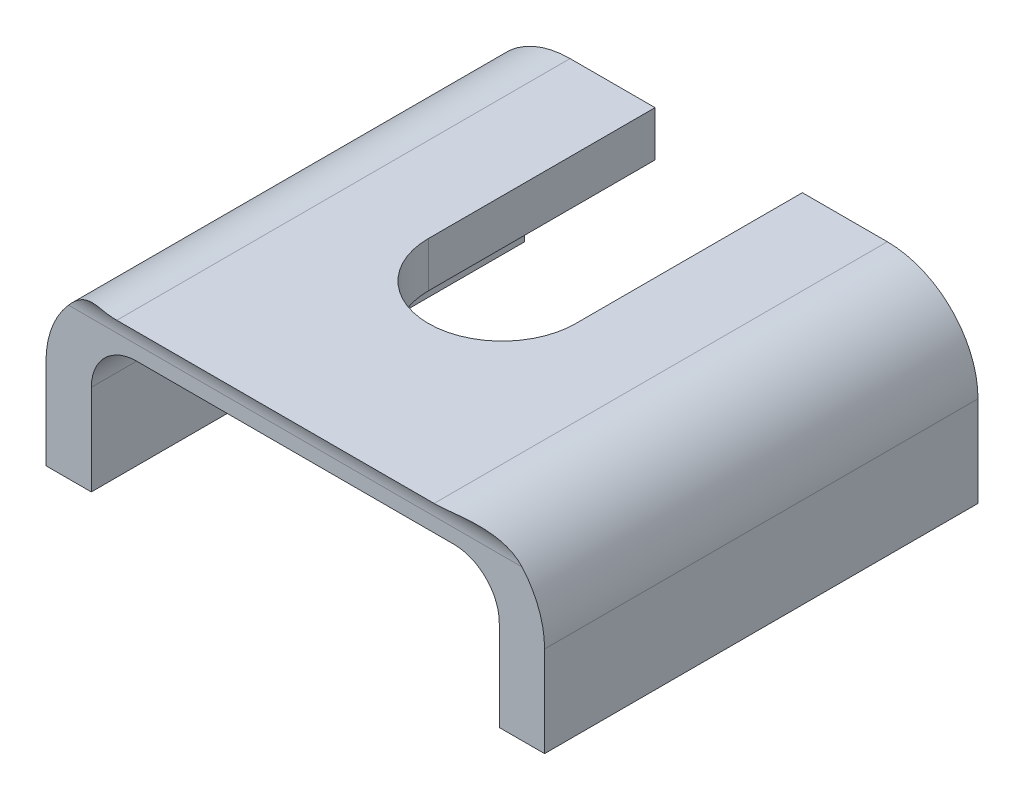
ISO-10303-21;
HEADER;
FILE_DESCRIPTION(('STEP AP214'),'2;1');
FILE_NAME('part.step','',(''),(''),'','','');
FILE_SCHEMA(('AUTOMOTIVE_DESIGN { 1 0 10303 214 1 1 1 1 }'));
ENDSEC;
DATA;
#1=APPLICATION_CONTEXT('core data for automotive mechanical design processes');
#2=APPLICATION_PROTOCOL_DEFINITION('international standard','automotive_design',2000,#1);
#3=PRODUCT_CONTEXT('',#1,'mechanical');
#4=PRODUCT('Part','Part','',(#3));
#5=PRODUCT_RELATED_PRODUCT_CATEGORY('part','',(#4));
#6=PRODUCT_DEFINITION_FORMATION('','',#4);
#7=PRODUCT_DEFINITION_CONTEXT('part definition',#1,'design');
#8=PRODUCT_DEFINITION('design','',#6,#7);
#9=PRODUCT_DEFINITION_SHAPE('','',#8);
#10=(LENGTH_UNIT() NAMED_UNIT(*) SI_UNIT(.MILLI.,.METRE.));
#11=(NAMED_UNIT(*) PLANE_ANGLE_UNIT() SI_UNIT($,.RADIAN.));
#12=(NAMED_UNIT(*) SI_UNIT($,.STERADIAN.) SOLID_ANGLE_UNIT());
#13=UNCERTAINTY_MEASURE_WITH_UNIT(LENGTH_MEASURE(1.E-05),#10,'distance_accuracy_value','');
#14=(GEOMETRIC_REPRESENTATION_CONTEXT(3) GLOBAL_UNCERTAINTY_ASSIGNED_CONTEXT((#13)) GLOBAL_UNIT_ASSIGNED_CONTEXT((#10,
#11,#12)) REPRESENTATION_CONTEXT('',''));
#15=CARTESIAN_POINT('',(0.,0.,0.));
#16=DIRECTION('',(0.,0.,1.));
#17=DIRECTION('',(1.,0.,0.));
#18=AXIS2_PLACEMENT_3D('',#15,#16,#17);
#19=CARTESIAN_POINT('',(187.879071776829,-19.05,60.721875));
#20=DIRECTION('',(0.,0.,1.));
#21=DIRECTION('',(1.,0.,0.));
#22=AXIS2_PLACEMENT_3D('',#19,#20,#21);
#23=PLANE('',#22);
#24=DIRECTION('',(0.,-1.,0.));
#25=VECTOR('',#24,1.);
#26=CARTESIAN_POINT('',(-28.575,0.,60.721875));
#27=LINE('',#26,#25);
#28=CARTESIAN_POINT('',(-28.575,-6.35,60.721875));
#29=VERTEX_POINT('',#28);
#30=CARTESIAN_POINT('',(-28.575,-19.05,60.721875));
#31=VERTEX_POINT('',#30);
#32=EDGE_CURVE('E59',#29,#31,#27,.T.);
#33=ORIENTED_EDGE('',*,*,#32,.F.);
#34=CARTESIAN_POINT('',(-22.225,-6.35,60.721875));
#35=DIRECTION('',(0.,0.,1.));
#36=DIRECTION('',(1.,0.,0.));
#37=AXIS2_PLACEMENT_3D('',#34,#35,#36);
#38=CIRCLE('',#37,6.35);
#39=CARTESIAN_POINT('',(-22.225,0.,60.721875));
#40=VERTEX_POINT('',#39);
#41=EDGE_CURVE('E570',#40,#29,#38,.T.);
#42=ORIENTED_EDGE('',*,*,#41,.F.);
#43=DIRECTION('',(-1.,0.,0.));
#44=VECTOR('',#43,1.);
#45=CARTESIAN_POINT('',(-28.575,0.,60.721875));
#46=LINE('',#45,#44);
#47=CARTESIAN_POINT('',(22.225,0.,60.721875));
#48=VERTEX_POINT('',#47);
#49=EDGE_CURVE('E572',#48,#40,#46,.T.);
#50=ORIENTED_EDGE('',*,*,#49,.F.);
#51=CARTESIAN_POINT('',(22.225,-6.35,60.721875));
#52=DIRECTION('',(0.,0.,1.));
#53=DIRECTION('',(1.,0.,0.));
#54=AXIS2_PLACEMENT_3D('',#51,#52,#53);
#55=CIRCLE('',#54,6.35);
#56=CARTESIAN_POINT('',(28.575,-6.35,60.721875));
#57=VERTEX_POINT('',#56);
#58=EDGE_CURVE('E576',#57,#48,#55,.T.);
#59=ORIENTED_EDGE('',*,*,#58,.F.);
#60=DIRECTION('',(0.,1.,0.));
#61=VECTOR('',#60,1.);
#62=CARTESIAN_POINT('',(28.575,0.,60.721875));
#63=LINE('',#62,#61);
#64=CARTESIAN_POINT('',(28.575,-19.05,60.721875));
#65=VERTEX_POINT('',#64);
#66=EDGE_CURVE('E585',#65,#57,#63,.T.);
#67=ORIENTED_EDGE('',*,*,#66,.F.);
#68=DIRECTION('',(-1.,0.,0.));
#69=VECTOR('',#68,1.);
#70=CARTESIAN_POINT('',(187.879071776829,-19.05,60.721875));
#71=LINE('',#70,#69);
#72=CARTESIAN_POINT('',(34.925,-19.05,60.721875));
#73=VERTEX_POINT('',#72);
#74=EDGE_CURVE('E177',#73,#65,#71,.T.);
#75=ORIENTED_EDGE('',*,*,#74,.F.);
#76=DIRECTION('',(0.,1.,0.));
#77=VECTOR('',#76,1.);
#78=CARTESIAN_POINT('',(34.925,0.,60.721875));
#79=LINE('',#78,#77);
#80=CARTESIAN_POINT('',(34.925,-6.34999999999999,60.721875));
#81=VERTEX_POINT('',#80);
#82=EDGE_CURVE('E584',#73,#81,#79,.T.);
#83=ORIENTED_EDGE('',*,*,#82,.T.);
#84=CARTESIAN_POINT('',(22.225,-6.35,60.721875));
#85=DIRECTION('',(0.,0.,1.));
#86=DIRECTION('',(1.,0.,0.));
#87=AXIS2_PLACEMENT_3D('',#84,#85,#86);
#88=CIRCLE('',#87,12.7);
#89=CARTESIAN_POINT('',(31.7760718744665,2.02060487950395,60.721875));
#90=VERTEX_POINT('',#89);
#91=EDGE_CURVE('E175',#81,#90,#88,.T.);
#92=ORIENTED_EDGE('',*,*,#91,.T.);
#93=DIRECTION('',(-1.,0.,0.));
#94=VECTOR('',#93,1.);
#95=CARTESIAN_POINT('',(187.879071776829,2.02060487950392,60.721875));
#96=LINE('',#95,#94);
#97=CARTESIAN_POINT('',(-31.7760718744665,2.02060487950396,60.721875));
#98=VERTEX_POINT('',#97);
#99=EDGE_CURVE('E169',#90,#98,#96,.T.);
#100=ORIENTED_EDGE('',*,*,#99,.T.);
#101=CARTESIAN_POINT('',(-22.225,-6.35,60.721875));
#102=DIRECTION('',(0.,0.,1.));
#103=DIRECTION('',(1.,0.,0.));
#104=AXIS2_PLACEMENT_3D('',#101,#102,#103);
#105=CIRCLE('',#104,12.7);
#106=CARTESIAN_POINT('',(-34.925,-6.35,60.721875));
#107=VERTEX_POINT('',#106);
#108=EDGE_CURVE('E11',#98,#107,#105,.T.);
#109=ORIENTED_EDGE('',*,*,#108,.T.);
#110=DIRECTION('',(0.,-1.,0.));
#111=VECTOR('',#110,1.);
#112=CARTESIAN_POINT('',(-34.925,0.,60.721875));
#113=LINE('',#112,#111);
#114=CARTESIAN_POINT('',(-34.925,-19.05,60.721875));
#115=VERTEX_POINT('',#114);
#116=EDGE_CURVE('E187',#107,#115,#113,.T.);
#117=ORIENTED_EDGE('',*,*,#116,.T.);
#118=EDGE_CURVE('E51',#31,#115,#71,.T.);
#119=ORIENTED_EDGE('',*,*,#118,.F.);
#120=EDGE_LOOP('',(#33,#42,#50,#59,#67,#75,#83,#92,#100,#109,#117,#119));
#121=FACE_BOUND('',#120,.T.);
#122=ADVANCED_FACE('F36',(#121),#23,.T.);
#123=CARTESIAN_POINT('',(187.879071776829,2.02060487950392,65.484375));
#124=DIRECTION('',(-1.,0.,0.));
#125=DIRECTION('',(0.,-1.,0.));
#126=AXIS2_PLACEMENT_3D('',#123,#124,#125);
#127=CYLINDRICAL_SURFACE('',#126,4.76250000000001);
#128=ORIENTED_EDGE('',*,*,#99,.F.);
#129=CARTESIAN_POINT('',(31.7760718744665,2.02060487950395,60.721875));
#130=CARTESIAN_POINT('',(31.6424498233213,2.17310917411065,60.7218945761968));
#131=CARTESIAN_POINT('',(31.5052236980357,2.32228408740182,60.7291966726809));
#132=CARTESIAN_POINT('',(31.2246195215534,2.61311589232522,60.7566187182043));
#133=CARTESIAN_POINT('',(31.0812504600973,2.75478313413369,60.7767204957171));
#134=CARTESIAN_POINT('',(30.7904475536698,3.0288431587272,60.8277563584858));
#135=CARTESIAN_POINT('',(30.6430664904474,3.16131244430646,60.8585837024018));
#136=CARTESIAN_POINT('',(30.3435491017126,3.418219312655,60.9296136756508));
#137=CARTESIAN_POINT('',(30.1914104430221,3.54265285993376,60.9698209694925));
#138=CARTESIAN_POINT('',(29.786003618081,3.85895205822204,61.0860239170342));
#139=CARTESIAN_POINT('',(29.5292967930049,4.04402171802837,61.1686261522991));
#140=CARTESIAN_POINT('',(29.0067926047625,4.39225244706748,61.3497372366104));
#141=CARTESIAN_POINT('',(28.7409909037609,4.55540287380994,61.4482537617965));
#142=CARTESIAN_POINT('',(28.1992597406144,4.86141529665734,61.6573886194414));
#143=CARTESIAN_POINT('',(27.9232628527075,5.00409080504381,61.7681037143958));
#144=CARTESIAN_POINT('',(27.3640368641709,5.26791247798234,61.996283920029));
#145=CARTESIAN_POINT('',(27.0808100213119,5.38906527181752,62.113746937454));
#146=CARTESIAN_POINT('',(26.5381766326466,5.59828997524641,62.3375649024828));
#147=CARTESIAN_POINT('',(26.279525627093,5.68852596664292,62.4437400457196));
#148=CARTESIAN_POINT('',(25.7556248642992,5.85246188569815,62.6531317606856));
#149=CARTESIAN_POINT('',(25.4903712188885,5.92615180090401,62.756346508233));
#150=CARTESIAN_POINT('',(24.9552794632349,6.05607217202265,62.9525631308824));
#151=CARTESIAN_POINT('',(24.6855213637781,6.11248191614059,63.045662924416));
#152=CARTESIAN_POINT('',(24.1376083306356,6.20822425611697,63.2139933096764));
#153=CARTESIAN_POINT('',(23.859467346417,6.24758370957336,63.2892519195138));
#154=CARTESIAN_POINT('',(23.4670358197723,6.28960514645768,63.3730366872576));
#155=CARTESIAN_POINT('',(23.3562601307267,6.3000090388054,63.3942705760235));
#156=CARTESIAN_POINT('',(23.1335969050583,6.31794868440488,63.431410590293));
#157=CARTESIAN_POINT('',(23.0217096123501,6.32548505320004,63.4473178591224));
#158=CARTESIAN_POINT('',(22.7959791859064,6.33766593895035,63.4732529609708));
#159=CARTESIAN_POINT('',(22.6821276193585,6.34228153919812,63.4832219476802));
#160=CARTESIAN_POINT('',(22.4538589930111,6.34845343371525,63.4966261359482));
#161=CARTESIAN_POINT('',(22.3394415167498,6.35000697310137,63.5000554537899));
#162=CARTESIAN_POINT('',(22.225,6.35,63.5));
#163=B_SPLINE_CURVE_WITH_KNOTS('',3,(#129,#130,#131,#132,#133,#134,#135,#136,#137,#138,#139,
#140,#141,#142,#143,#144,#145,#146,#147,#148,#149,#150,#151,#152,#153,#154,#155,#156,#157,#158,
#159,#160,#161,#162),.UNSPECIFIED.,.F.,.F.,(4,2,2,2,2,2,2,2,2,2,2,2,2,2,2,2,4),(0.,
0.607910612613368,1.21496010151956,1.81613329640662,2.41760608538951,3.39726866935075,
4.37740520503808,5.36596839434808,6.35422656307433,7.23510595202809,8.11651695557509,
8.98844641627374,9.85899737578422,10.1986742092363,10.5382780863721,10.8811936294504,
11.2244175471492),.UNSPECIFIED.);
#164=CARTESIAN_POINT('',(22.225,6.35,63.5));
#165=VERTEX_POINT('',#164);
#166=EDGE_CURVE('E180',#90,#165,#163,.T.);
#167=ORIENTED_EDGE('',*,*,#166,.T.);
#168=DIRECTION('',(1.,0.,0.));
#169=VECTOR('',#168,1.);
#170=CARTESIAN_POINT('',(-28.575,6.35,63.5));
#171=LINE('',#170,#169);
#172=CARTESIAN_POINT('',(-22.225,6.35,63.5));
#173=VERTEX_POINT('',#172);
#174=EDGE_CURVE('E171',#165,#173,#171,.F.);
#175=ORIENTED_EDGE('',*,*,#174,.T.);
#176=CARTESIAN_POINT('',(-22.225,6.35,63.5));
#177=CARTESIAN_POINT('',(-22.3277513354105,6.35000465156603,63.5000367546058));
#178=CARTESIAN_POINT('',(-22.430488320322,6.34875320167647,63.4972801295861));
#179=CARTESIAN_POINT('',(-22.6355649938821,6.3437748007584,63.4864582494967));
#180=CARTESIAN_POINT('',(-22.7379048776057,6.34004927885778,63.4783960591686));
#181=CARTESIAN_POINT('',(-22.941451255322,6.33018295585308,63.4572910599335));
#182=CARTESIAN_POINT('',(-23.0426608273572,6.32405376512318,63.4442722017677));
#183=CARTESIAN_POINT('',(-23.2442278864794,6.3094386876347,63.4137232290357));
#184=CARTESIAN_POINT('',(-23.3445852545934,6.30095247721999,63.3961924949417));
#185=CARTESIAN_POINT('',(-23.6420703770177,6.27225498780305,63.3380456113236));
#186=CARTESIAN_POINT('',(-23.8377548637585,6.24869814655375,63.2916304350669));
#187=CARTESIAN_POINT('',(-24.2250545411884,6.19305215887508,63.1875156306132));
#188=CARTESIAN_POINT('',(-24.4166632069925,6.16095030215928,63.1297992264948));
#189=CARTESIAN_POINT('',(-24.780178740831,6.0915595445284,63.0119217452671));
#190=CARTESIAN_POINT('',(-24.9524057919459,6.05491801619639,62.9523562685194));
#191=CARTESIAN_POINT('',(-25.2938202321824,5.9748972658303,62.8291201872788));
#192=CARTESIAN_POINT('',(-25.4630070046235,5.93151669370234,62.765448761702));
#193=CARTESIAN_POINT('',(-25.7986544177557,5.83808217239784,62.6357499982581));
#194=CARTESIAN_POINT('',(-25.9651144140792,5.78802667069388,62.569722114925));
#195=CARTESIAN_POINT('',(-26.2955001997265,5.68125754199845,62.4367015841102));
#196=CARTESIAN_POINT('',(-26.4594257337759,5.62454324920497,62.3697088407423));
#197=CARTESIAN_POINT('',(-26.9498896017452,5.44353797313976,62.1681041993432));
#198=CARTESIAN_POINT('',(-27.2728406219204,5.30901783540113,62.0337796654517));
#199=CARTESIAN_POINT('',(-27.909154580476,5.01236959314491,61.7736161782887));
#200=CARTESIAN_POINT('',(-28.2225232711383,4.85025845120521,61.6477720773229));
#201=CARTESIAN_POINT('',(-28.7486783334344,4.5492963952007,61.4458512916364));
#202=CARTESIAN_POINT('',(-28.9640648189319,4.41751975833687,61.36598714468));
#203=CARTESIAN_POINT('',(-29.389062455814,4.13955087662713,61.2163079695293));
#204=CARTESIAN_POINT('',(-29.5986727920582,3.99335661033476,61.1464943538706));
#205=CARTESIAN_POINT('',(-30.0100249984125,3.6873667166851,61.0200078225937));
#206=CARTESIAN_POINT('',(-30.2118034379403,3.52764932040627,60.9632655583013));
#207=CARTESIAN_POINT('',(-30.6073605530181,3.19425764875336,60.8654905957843));
#208=CARTESIAN_POINT('',(-30.8011447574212,3.02059327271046,60.8244468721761));
#209=CARTESIAN_POINT('',(-31.1264020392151,2.71037808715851,60.7702460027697));
#210=CARTESIAN_POINT('',(-31.2601547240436,2.57701798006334,60.7525011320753));
#211=CARTESIAN_POINT('',(-31.5223571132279,2.30362508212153,60.7283103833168));
#212=CARTESIAN_POINT('',(-31.6507938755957,2.16357761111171,60.721890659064));
#213=CARTESIAN_POINT('',(-31.7760718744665,2.02060487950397,60.721875));
#214=B_SPLINE_CURVE_WITH_KNOTS('',3,(#176,#177,#178,#179,#180,#181,#182,#183,#184,#185,#186,
#187,#188,#189,#190,#191,#192,#193,#194,#195,#196,#197,#198,#199,#200,#201,#202,#203,#204,#205,
#206,#207,#208,#209,#210,#211,#212,#213),.UNSPECIFIED.,.F.,.F.,(4,2,2,2,2,2,2,2,2,2,2,2,2,2,2,2,
2,2,4),(0.,0.308186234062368,0.616194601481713,0.922733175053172,1.22931386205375,
1.83602123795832,2.44363615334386,3.0010678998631,3.55861146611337,4.116284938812,
4.67401421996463,5.79704810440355,6.91939404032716,7.71332410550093,8.50736564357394,
9.2970921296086,10.0862629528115,10.6548968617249,11.2248422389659),.UNSPECIFIED.);
#215=EDGE_CURVE('E44',#173,#98,#214,.T.);
#216=ORIENTED_EDGE('',*,*,#215,.T.);
#217=EDGE_LOOP('',(#128,#167,#175,#216));
#218=FACE_BOUND('',#217,.T.);
#219=ADVANCED_FACE('F167',(#218),#127,.F.);
#220=CARTESIAN_POINT('',(-34.925,0.,63.5));
#221=DIRECTION('',(1.,0.,0.));
#222=DIRECTION('',(0.,1.,0.));
#223=AXIS2_PLACEMENT_3D('',#220,#221,#222);
#224=PLANE('',#223);
#225=ORIENTED_EDGE('',*,*,#116,.F.);
#226=DIRECTION('',(0.,0.,-1.));
#227=VECTOR('',#226,1.);
#228=CARTESIAN_POINT('',(-34.925,-6.35,63.5));
#229=LINE('',#228,#227);
#230=CARTESIAN_POINT('',(-34.925,-6.35,0.));
#231=VERTEX_POINT('',#230);
#232=EDGE_CURVE('E160',#107,#231,#229,.T.);
#233=ORIENTED_EDGE('',*,*,#232,.T.);
#234=DIRECTION('',(0.,-1.,0.));
#235=VECTOR('',#234,1.);
#236=CARTESIAN_POINT('',(-34.925,0.,0.));
#237=LINE('',#236,#235);
#238=CARTESIAN_POINT('',(-34.925,-19.05,0.));
#239=VERTEX_POINT('',#238);
#240=EDGE_CURVE('E556',#231,#239,#237,.T.);
#241=ORIENTED_EDGE('',*,*,#240,.T.);
#242=DIRECTION('',(0.,0.,-1.));
#243=VECTOR('',#242,1.);
#244=CARTESIAN_POINT('',(-34.925,-19.05,63.5));
#245=LINE('',#244,#243);
#246=EDGE_CURVE('E524',#115,#239,#245,.T.);
#247=ORIENTED_EDGE('',*,*,#246,.F.);
#248=EDGE_LOOP('',(#225,#233,#241,#247));
#249=FACE_BOUND('',#248,.T.);
#250=ADVANCED_FACE('F196',(#249),#224,.F.);
#251=CARTESIAN_POINT('',(-28.575,-19.05,63.5));
#252=DIRECTION('',(0.,-1.,0.));
#253=DIRECTION('',(0.,0.,-1.));
#254=AXIS2_PLACEMENT_3D('',#251,#252,#253);
#255=PLANE('',#254);
#256=DIRECTION('',(0.,0.,-1.));
#257=VECTOR('',#256,1.);
#258=CARTESIAN_POINT('',(-28.575,-19.05,63.5));
#259=LINE('',#258,#257);
#260=CARTESIAN_POINT('',(-28.575,-19.05,0.));
#261=VERTEX_POINT('',#260);
#262=EDGE_CURVE('E522',#31,#261,#259,.T.);
#263=ORIENTED_EDGE('',*,*,#262,.F.);
#264=ORIENTED_EDGE('',*,*,#118,.T.);
#265=ORIENTED_EDGE('',*,*,#246,.T.);
#266=DIRECTION('',(-1.,0.,0.));
#267=VECTOR('',#266,1.);
#268=CARTESIAN_POINT('',(-28.575,-19.05,0.));
#269=LINE('',#268,#267);
#270=EDGE_CURVE('E560',#261,#239,#269,.T.);
#271=ORIENTED_EDGE('',*,*,#270,.F.);
#272=EDGE_LOOP('',(#263,#264,#265,#271));
#273=FACE_BOUND('',#272,.T.);
#274=ADVANCED_FACE('F239',(#273),#255,.T.);
#275=CARTESIAN_POINT('',(-28.575,0.,63.5));
#276=DIRECTION('',(1.,0.,0.));
#277=DIRECTION('',(0.,1.,0.));
#278=AXIS2_PLACEMENT_3D('',#275,#276,#277);
#279=PLANE('',#278);
#280=DIRECTION('',(0.,0.,-1.));
#281=VECTOR('',#280,1.);
#282=CARTESIAN_POINT('',(-28.575,-6.35,63.5));
#283=LINE('',#282,#281);
#284=CARTESIAN_POINT('',(-28.575,-6.35,0.));
#285=VERTEX_POINT('',#284);
#286=EDGE_CURVE('E520',#29,#285,#283,.T.);
#287=ORIENTED_EDGE('',*,*,#286,.F.);
#288=ORIENTED_EDGE('',*,*,#32,.T.);
#289=ORIENTED_EDGE('',*,*,#262,.T.);
#290=DIRECTION('',(0.,-1.,0.));
#291=VECTOR('',#290,1.);
#292=CARTESIAN_POINT('',(-28.575,0.,0.));
#293=LINE('',#292,#291);
#294=EDGE_CURVE('E481',#285,#261,#293,.T.);
#295=ORIENTED_EDGE('',*,*,#294,.F.);
#296=EDGE_LOOP('',(#287,#288,#289,#295));
#297=FACE_BOUND('',#296,.T.);
#298=ADVANCED_FACE('F247',(#297),#279,.T.);
#299=CARTESIAN_POINT('',(-22.225,-6.35,63.5));
#300=DIRECTION('',(0.,0.,-1.));
#301=DIRECTION('',(-1.,0.,0.));
#302=AXIS2_PLACEMENT_3D('',#299,#300,#301);
#303=CYLINDRICAL_SURFACE('',#302,6.35);
#304=DIRECTION('',(0.,0.,-1.));
#305=VECTOR('',#304,1.);
#306=CARTESIAN_POINT('',(-22.225,0.,63.5));
#307=LINE('',#306,#305);
#308=CARTESIAN_POINT('',(-22.225,0.,0.));
#309=VERTEX_POINT('',#308);
#310=EDGE_CURVE('E474',#40,#309,#307,.T.);
#311=ORIENTED_EDGE('',*,*,#310,.F.);
#312=ORIENTED_EDGE('',*,*,#41,.T.);
#313=ORIENTED_EDGE('',*,*,#286,.T.);
#314=CARTESIAN_POINT('',(-22.225,-6.35,0.));
#315=DIRECTION('',(0.,0.,-1.));
#316=DIRECTION('',(-1.,0.,0.));
#317=AXIS2_PLACEMENT_3D('',#314,#315,#316);
#318=CIRCLE('',#317,6.35);
#319=EDGE_CURVE('E476',#309,#285,#318,.F.);
#320=ORIENTED_EDGE('',*,*,#319,.F.);
#321=EDGE_LOOP('',(#311,#312,#313,#320));
#322=FACE_BOUND('',#321,.T.);
#323=ADVANCED_FACE('F254',(#322),#303,.F.);
#324=CARTESIAN_POINT('',(-28.575,0.,63.5));
#325=DIRECTION('',(0.,-1.,0.));
#326=DIRECTION('',(0.,0.,-1.));
#327=AXIS2_PLACEMENT_3D('',#324,#325,#326);
#328=PLANE('',#327);
#329=DIRECTION('',(0.,0.,-1.));
#330=VECTOR('',#329,1.);
#331=CARTESIAN_POINT('',(22.225,0.,63.5));
#332=LINE('',#331,#330);
#333=CARTESIAN_POINT('',(22.225,0.,0.));
#334=VERTEX_POINT('',#333);
#335=EDGE_CURVE('E517',#48,#334,#332,.T.);
#336=ORIENTED_EDGE('',*,*,#335,.F.);
#337=ORIENTED_EDGE('',*,*,#49,.T.);
#338=ORIENTED_EDGE('',*,*,#310,.T.);
#339=DIRECTION('',(-1.,0.,0.));
#340=VECTOR('',#339,1.);
#341=CARTESIAN_POINT('',(-28.575,0.,0.));
#342=LINE('',#341,#340);
#343=CARTESIAN_POINT('',(-10.31875,0.,0.));
#344=VERTEX_POINT('',#343);
#345=EDGE_CURVE('E467',#344,#309,#342,.T.);
#346=ORIENTED_EDGE('',*,*,#345,.F.);
#347=DIRECTION('',(0.,0.,-1.));
#348=VECTOR('',#347,1.);
#349=CARTESIAN_POINT('',(-10.31875,0.,63.5));
#350=LINE('',#349,#348);
#351=CARTESIAN_POINT('',(-10.31875,0.,31.75));
#352=VERTEX_POINT('',#351);
#353=EDGE_CURVE('E453',#352,#344,#350,.T.);
#354=ORIENTED_EDGE('',*,*,#353,.F.);
#355=CARTESIAN_POINT('',(0.,0.,31.75));
#356=DIRECTION('',(0.,-1.,0.));
#357=DIRECTION('',(0.,0.,-1.));
#358=AXIS2_PLACEMENT_3D('',#355,#356,#357);
#359=CIRCLE('',#358,10.31875);
#360=CARTESIAN_POINT('',(10.31875,0.,31.75));
#361=VERTEX_POINT('',#360);
#362=EDGE_CURVE('E461',#361,#352,#359,.T.);
#363=ORIENTED_EDGE('',*,*,#362,.F.);
#364=DIRECTION('',(0.,0.,1.));
#365=VECTOR('',#364,1.);
#366=CARTESIAN_POINT('',(10.31875,0.,63.5));
#367=LINE('',#366,#365);
#368=CARTESIAN_POINT('',(10.31875,0.,0.));
#369=VERTEX_POINT('',#368);
#370=EDGE_CURVE('E554',#369,#361,#367,.T.);
#371=ORIENTED_EDGE('',*,*,#370,.F.);
#372=EDGE_CURVE('E475',#334,#369,#342,.T.);
#373=ORIENTED_EDGE('',*,*,#372,.F.);
#374=EDGE_LOOP('',(#336,#337,#338,#346,#354,#363,#371,#373));
#375=FACE_BOUND('',#374,.T.);
#376=ADVANCED_FACE('F261',(#375),#328,.T.);
#377=CARTESIAN_POINT('',(22.225,-6.35,63.5));
#378=DIRECTION('',(0.,0.,-1.));
#379=DIRECTION('',(-1.,0.,0.));
#380=AXIS2_PLACEMENT_3D('',#377,#378,#379);
#381=CYLINDRICAL_SURFACE('',#380,6.35);
#382=DIRECTION('',(0.,0.,-1.));
#383=VECTOR('',#382,1.);
#384=CARTESIAN_POINT('',(28.575,-6.35,63.5));
#385=LINE('',#384,#383);
#386=CARTESIAN_POINT('',(28.575,-6.35,0.));
#387=VERTEX_POINT('',#386);
#388=EDGE_CURVE('E515',#57,#387,#385,.T.);
#389=ORIENTED_EDGE('',*,*,#388,.F.);
#390=ORIENTED_EDGE('',*,*,#58,.T.);
#391=ORIENTED_EDGE('',*,*,#335,.T.);
#392=CARTESIAN_POINT('',(22.225,-6.35,0.));
#393=DIRECTION('',(0.,0.,-1.));
#394=DIRECTION('',(-1.,0.,0.));
#395=AXIS2_PLACEMENT_3D('',#392,#393,#394);
#396=CIRCLE('',#395,6.35);
#397=EDGE_CURVE('E479',#387,#334,#396,.F.);
#398=ORIENTED_EDGE('',*,*,#397,.F.);
#399=EDGE_LOOP('',(#389,#390,#391,#398));
#400=FACE_BOUND('',#399,.T.);
#401=ADVANCED_FACE('F269',(#400),#381,.F.);
#402=CARTESIAN_POINT('',(28.575,0.,63.5));
#403=DIRECTION('',(-1.,0.,0.));
#404=DIRECTION('',(0.,-1.,0.));
#405=AXIS2_PLACEMENT_3D('',#402,#403,#404);
#406=PLANE('',#405);
#407=DIRECTION('',(0.,0.,-1.));
#408=VECTOR('',#407,1.);
#409=CARTESIAN_POINT('',(28.575,-19.05,63.5));
#410=LINE('',#409,#408);
#411=CARTESIAN_POINT('',(28.575,-19.05,0.));
#412=VERTEX_POINT('',#411);
#413=EDGE_CURVE('E513',#65,#412,#410,.T.);
#414=ORIENTED_EDGE('',*,*,#413,.F.);
#415=ORIENTED_EDGE('',*,*,#66,.T.);
#416=ORIENTED_EDGE('',*,*,#388,.T.);
#417=DIRECTION('',(0.,1.,0.));
#418=VECTOR('',#417,1.);
#419=CARTESIAN_POINT('',(28.575,0.,0.));
#420=LINE('',#419,#418);
#421=EDGE_CURVE('E487',#412,#387,#420,.T.);
#422=ORIENTED_EDGE('',*,*,#421,.F.);
#423=EDGE_LOOP('',(#414,#415,#416,#422));
#424=FACE_BOUND('',#423,.T.);
#425=ADVANCED_FACE('F277',(#424),#406,.T.);
#426=CARTESIAN_POINT('',(34.925,-19.05,63.5));
#427=DIRECTION('',(0.,-1.,0.));
#428=DIRECTION('',(0.,0.,-1.));
#429=AXIS2_PLACEMENT_3D('',#426,#427,#428);
#430=PLANE('',#429);
#431=DIRECTION('',(0.,0.,-1.));
#432=VECTOR('',#431,1.);
#433=CARTESIAN_POINT('',(34.925,-19.05,63.5));
#434=LINE('',#433,#432);
#435=CARTESIAN_POINT('',(34.925,-19.05,0.));
#436=VERTEX_POINT('',#435);
#437=EDGE_CURVE('E511',#73,#436,#434,.T.);
#438=ORIENTED_EDGE('',*,*,#437,.F.);
#439=ORIENTED_EDGE('',*,*,#74,.T.);
#440=ORIENTED_EDGE('',*,*,#413,.T.);
#441=DIRECTION('',(-1.,0.,0.));
#442=VECTOR('',#441,1.);
#443=CARTESIAN_POINT('',(34.925,-19.05,0.));
#444=LINE('',#443,#442);
#445=EDGE_CURVE('E490',#436,#412,#444,.T.);
#446=ORIENTED_EDGE('',*,*,#445,.F.);
#447=EDGE_LOOP('',(#438,#439,#440,#446));
#448=FACE_BOUND('',#447,.T.);
#449=ADVANCED_FACE('F285',(#448),#430,.T.);
#450=CARTESIAN_POINT('',(34.925,0.,63.5));
#451=DIRECTION('',(-1.,0.,0.));
#452=DIRECTION('',(0.,-1.,0.));
#453=AXIS2_PLACEMENT_3D('',#450,#451,#452);
#454=PLANE('',#453);
#455=ORIENTED_EDGE('',*,*,#82,.F.);
#456=ORIENTED_EDGE('',*,*,#437,.T.);
#457=DIRECTION('',(0.,1.,0.));
#458=VECTOR('',#457,1.);
#459=CARTESIAN_POINT('',(34.925,0.,0.));
#460=LINE('',#459,#458);
#461=CARTESIAN_POINT('',(34.925,-6.34999999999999,0.));
#462=VERTEX_POINT('',#461);
#463=EDGE_CURVE('E493',#436,#462,#460,.T.);
#464=ORIENTED_EDGE('',*,*,#463,.T.);
#465=DIRECTION('',(0.,0.,-1.));
#466=VECTOR('',#465,1.);
#467=CARTESIAN_POINT('',(34.925,-6.34999999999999,63.5));
#468=LINE('',#467,#466);
#469=EDGE_CURVE('E509',#81,#462,#468,.T.);
#470=ORIENTED_EDGE('',*,*,#469,.F.);
#471=EDGE_LOOP('',(#455,#456,#464,#470));
#472=FACE_BOUND('',#471,.T.);
#473=ADVANCED_FACE('F293',(#472),#454,.F.);
#474=CARTESIAN_POINT('',(22.225,-6.35,63.5));
#475=DIRECTION('',(0.,0.,-1.));
#476=DIRECTION('',(-1.,0.,0.));
#477=AXIS2_PLACEMENT_3D('',#474,#475,#476);
#478=CYLINDRICAL_SURFACE('',#477,12.7);
#479=ORIENTED_EDGE('',*,*,#91,.F.);
#480=ORIENTED_EDGE('',*,*,#469,.T.);
#481=CARTESIAN_POINT('',(22.225,-6.35,0.));
#482=DIRECTION('',(0.,0.,1.));
#483=DIRECTION('',(1.,0.,0.));
#484=AXIS2_PLACEMENT_3D('',#481,#482,#483);
#485=CIRCLE('',#484,12.7);
#486=CARTESIAN_POINT('',(22.225,6.35,0.));
#487=VERTEX_POINT('',#486);
#488=EDGE_CURVE('E496',#462,#487,#485,.T.);
#489=ORIENTED_EDGE('',*,*,#488,.T.);
#490=DIRECTION('',(0.,0.,-1.));
#491=VECTOR('',#490,1.);
#492=CARTESIAN_POINT('',(22.225,6.35,63.5));
#493=LINE('',#492,#491);
#494=EDGE_CURVE('E506',#165,#487,#493,.T.);
#495=ORIENTED_EDGE('',*,*,#494,.F.);
#496=ORIENTED_EDGE('',*,*,#166,.F.);
#497=EDGE_LOOP('',(#479,#480,#489,#495,#496));
#498=FACE_BOUND('',#497,.T.);
#499=ADVANCED_FACE('F189',(#498),#478,.T.);
#500=CARTESIAN_POINT('',(-22.225,-6.35,63.5));
#501=DIRECTION('',(0.,0.,-1.));
#502=DIRECTION('',(-1.,0.,0.));
#503=AXIS2_PLACEMENT_3D('',#500,#501,#502);
#504=CYLINDRICAL_SURFACE('',#503,12.7);
#505=ORIENTED_EDGE('',*,*,#108,.F.);
#506=ORIENTED_EDGE('',*,*,#215,.F.);
#507=DIRECTION('',(0.,0.,-1.));
#508=VECTOR('',#507,1.);
#509=CARTESIAN_POINT('',(-22.225,6.35,63.5));
#510=LINE('',#509,#508);
#511=CARTESIAN_POINT('',(-22.225,6.35,0.));
#512=VERTEX_POINT('',#511);
#513=EDGE_CURVE('E504',#173,#512,#510,.T.);
#514=ORIENTED_EDGE('',*,*,#513,.T.);
#515=CARTESIAN_POINT('',(-22.225,-6.35,0.));
#516=DIRECTION('',(0.,0.,1.));
#517=DIRECTION('',(1.,0.,0.));
#518=AXIS2_PLACEMENT_3D('',#515,#516,#517);
#519=CIRCLE('',#518,12.7);
#520=EDGE_CURVE('E501',#512,#231,#519,.T.);
#521=ORIENTED_EDGE('',*,*,#520,.T.);
#522=ORIENTED_EDGE('',*,*,#232,.F.);
#523=EDGE_LOOP('',(#505,#506,#514,#521,#522));
#524=FACE_BOUND('',#523,.T.);
#525=ADVANCED_FACE('F156',(#524),#504,.T.);
#526=CARTESIAN_POINT('',(-34.925,-6.35,0.));
#527=DIRECTION('',(0.,0.,-1.));
#528=DIRECTION('',(-1.,0.,0.));
#529=AXIS2_PLACEMENT_3D('',#526,#527,#528);
#530=PLANE('',#529);
#531=DIRECTION('',(0.,1.,0.));
#532=VECTOR('',#531,1.);
#533=CARTESIAN_POINT('',(10.31875,-19.05,0.));
#534=LINE('',#533,#532);
#535=CARTESIAN_POINT('',(10.31875,6.35,0.));
#536=VERTEX_POINT('',#535);
#537=EDGE_CURVE('E462',#369,#536,#534,.T.);
#538=ORIENTED_EDGE('',*,*,#537,.T.);
#539=DIRECTION('',(1.,0.,0.));
#540=VECTOR('',#539,1.);
#541=CARTESIAN_POINT('',(-28.575,6.35,0.));
#542=LINE('',#541,#540);
#543=EDGE_CURVE('E499',#487,#536,#542,.F.);
#544=ORIENTED_EDGE('',*,*,#543,.F.);
#545=DIRECTION('',(0.,-1.,0.));
#546=VECTOR('',#545,1.);
#547=CARTESIAN_POINT('',(22.225,6.35,0.));
#548=LINE('',#547,#546);
#549=EDGE_CURVE('E530',#487,#334,#548,.T.);
#550=ORIENTED_EDGE('',*,*,#549,.T.);
#551=ORIENTED_EDGE('',*,*,#372,.T.);
#552=EDGE_LOOP('',(#538,#544,#550,#551));
#553=FACE_BOUND('',#552,.T.);
#554=ADVANCED_FACE('F208',(#553),#530,.T.);
#555=CARTESIAN_POINT('',(28.575,-6.35,0.));
#556=DIRECTION('',(0.,0.,-1.));
#557=DIRECTION('',(-1.,0.,0.));
#558=AXIS2_PLACEMENT_3D('',#555,#556,#557);
#559=PLANE('',#558);
#560=DIRECTION('',(1.,0.,0.));
#561=VECTOR('',#560,1.);
#562=CARTESIAN_POINT('',(28.575,-6.35,0.));
#563=LINE('',#562,#561);
#564=EDGE_CURVE('E172',#387,#462,#563,.T.);
#565=ORIENTED_EDGE('',*,*,#564,.F.);
#566=ORIENTED_EDGE('',*,*,#397,.T.);
#567=ORIENTED_EDGE('',*,*,#549,.F.);
#568=ORIENTED_EDGE('',*,*,#488,.F.);
#569=EDGE_LOOP('',(#565,#566,#567,#568));
#570=FACE_BOUND('',#569,.T.);
#571=ADVANCED_FACE('F38',(#570),#559,.T.);
#572=CARTESIAN_POINT('',(22.225,6.35,0.));
#573=DIRECTION('',(0.,0.,-1.));
#574=DIRECTION('',(-1.,0.,0.));
#575=AXIS2_PLACEMENT_3D('',#572,#573,#574);
#576=PLANE('',#575);
#577=ORIENTED_EDGE('',*,*,#421,.T.);
#578=ORIENTED_EDGE('',*,*,#564,.T.);
#579=ORIENTED_EDGE('',*,*,#463,.F.);
#580=ORIENTED_EDGE('',*,*,#445,.T.);
#581=EDGE_LOOP('',(#577,#578,#579,#580));
#582=FACE_BOUND('',#581,.T.);
#583=ADVANCED_FACE('F325',(#582),#576,.T.);
#584=CARTESIAN_POINT('',(-22.225,0.,0.));
#585=DIRECTION('',(0.,0.,-1.));
#586=DIRECTION('',(-1.,0.,0.));
#587=AXIS2_PLACEMENT_3D('',#584,#585,#586);
#588=PLANE('',#587);
#589=DIRECTION('',(0.,1.,0.));
#590=VECTOR('',#589,1.);
#591=CARTESIAN_POINT('',(-22.225,0.,0.));
#592=LINE('',#591,#590);
#593=EDGE_CURVE('E529',#309,#512,#592,.T.);
#594=ORIENTED_EDGE('',*,*,#593,.F.);
#595=ORIENTED_EDGE('',*,*,#319,.T.);
#596=DIRECTION('',(1.,0.,0.));
#597=VECTOR('',#596,1.);
#598=CARTESIAN_POINT('',(-34.925,-6.35,0.));
#599=LINE('',#598,#597);
#600=EDGE_CURVE('E526',#231,#285,#599,.T.);
#601=ORIENTED_EDGE('',*,*,#600,.F.);
#602=ORIENTED_EDGE('',*,*,#520,.F.);
#603=EDGE_LOOP('',(#594,#595,#601,#602));
#604=FACE_BOUND('',#603,.T.);
#605=ADVANCED_FACE('F221',(#604),#588,.T.);
#606=DIRECTION('',(0.,1.,0.));
#607=VECTOR('',#606,1.);
#608=CARTESIAN_POINT('',(-10.31875,-19.05,0.));
#609=LINE('',#608,#607);
#610=CARTESIAN_POINT('',(-10.31875,6.35,0.));
#611=VERTEX_POINT('',#610);
#612=EDGE_CURVE('E456',#344,#611,#609,.T.);
#613=ORIENTED_EDGE('',*,*,#612,.F.);
#614=ORIENTED_EDGE('',*,*,#345,.T.);
#615=ORIENTED_EDGE('',*,*,#593,.T.);
#616=EDGE_CURVE('E469',#611,#512,#542,.F.);
#617=ORIENTED_EDGE('',*,*,#616,.F.);
#618=EDGE_LOOP('',(#613,#614,#615,#617));
#619=FACE_BOUND('',#618,.T.);
#620=ADVANCED_FACE('F213',(#619),#530,.T.);
#621=CARTESIAN_POINT('',(-28.575,6.35,63.5));
#622=DIRECTION('',(0.,-1.,0.));
#623=DIRECTION('',(0.,0.,-1.));
#624=AXIS2_PLACEMENT_3D('',#621,#622,#623);
#625=PLANE('',#624);
#626=ORIENTED_EDGE('',*,*,#543,.T.);
#627=DIRECTION('',(0.,0.,-1.));
#628=VECTOR('',#627,1.);
#629=CARTESIAN_POINT('',(10.31875,6.35,0.));
#630=LINE('',#629,#628);
#631=CARTESIAN_POINT('',(10.31875,6.35,31.75));
#632=VERTEX_POINT('',#631);
#633=EDGE_CURVE('E470',#632,#536,#630,.T.);
#634=ORIENTED_EDGE('',*,*,#633,.F.);
#635=CARTESIAN_POINT('',(0.,6.35,31.75));
#636=DIRECTION('',(0.,1.,0.));
#637=DIRECTION('',(0.,0.,1.));
#638=AXIS2_PLACEMENT_3D('',#635,#636,#637);
#639=CIRCLE('',#638,10.31875);
#640=CARTESIAN_POINT('',(-10.31875,6.35,31.75));
#641=VERTEX_POINT('',#640);
#642=EDGE_CURVE('E580',#641,#632,#639,.T.);
#643=ORIENTED_EDGE('',*,*,#642,.F.);
#644=DIRECTION('',(0.,0.,1.));
#645=VECTOR('',#644,1.);
#646=CARTESIAN_POINT('',(-10.31875,6.35,0.));
#647=LINE('',#646,#645);
#648=EDGE_CURVE('E574',#611,#641,#647,.T.);
#649=ORIENTED_EDGE('',*,*,#648,.F.);
#650=ORIENTED_EDGE('',*,*,#616,.T.);
#651=ORIENTED_EDGE('',*,*,#513,.F.);
#652=ORIENTED_EDGE('',*,*,#174,.F.);
#653=ORIENTED_EDGE('',*,*,#494,.T.);
#654=EDGE_LOOP('',(#626,#634,#643,#649,#650,#651,#652,#653));
#655=FACE_BOUND('',#654,.T.);
#656=ADVANCED_FACE('F211',(#655),#625,.F.);
#657=CARTESIAN_POINT('',(-22.225,-6.35,0.));
#658=DIRECTION('',(0.,0.,-1.));
#659=DIRECTION('',(-1.,0.,0.));
#660=AXIS2_PLACEMENT_3D('',#657,#658,#659);
#661=PLANE('',#660);
#662=ORIENTED_EDGE('',*,*,#240,.F.);
#663=ORIENTED_EDGE('',*,*,#600,.T.);
#664=ORIENTED_EDGE('',*,*,#294,.T.);
#665=ORIENTED_EDGE('',*,*,#270,.T.);
#666=EDGE_LOOP('',(#662,#663,#664,#665));
#667=FACE_BOUND('',#666,.T.);
#668=ADVANCED_FACE('F209',(#667),#661,.T.);
#669=CARTESIAN_POINT('',(10.31875,-19.05,0.));
#670=DIRECTION('',(1.,0.,0.));
#671=DIRECTION('',(0.,0.,-1.));
#672=AXIS2_PLACEMENT_3D('',#669,#670,#671);
#673=PLANE('',#672);
#674=ORIENTED_EDGE('',*,*,#370,.T.);
#675=DIRECTION('',(0.,1.,0.));
#676=VECTOR('',#675,1.);
#677=CARTESIAN_POINT('',(10.31875,-19.05,31.75));
#678=LINE('',#677,#676);
#679=EDGE_CURVE('E546',#361,#632,#678,.T.);
#680=ORIENTED_EDGE('',*,*,#679,.T.);
#681=ORIENTED_EDGE('',*,*,#633,.T.);
#682=ORIENTED_EDGE('',*,*,#537,.F.);
#683=EDGE_LOOP('',(#674,#680,#681,#682));
#684=FACE_BOUND('',#683,.T.);
#685=ADVANCED_FACE('F219',(#684),#673,.F.);
#686=CARTESIAN_POINT('',(0.,-19.05,31.75));
#687=DIRECTION('',(0.,1.,0.));
#688=DIRECTION('',(0.,0.,1.));
#689=AXIS2_PLACEMENT_3D('',#686,#687,#688);
#690=CYLINDRICAL_SURFACE('',#689,10.31875);
#691=ORIENTED_EDGE('',*,*,#362,.T.);
#692=DIRECTION('',(0.,1.,0.));
#693=VECTOR('',#692,1.);
#694=CARTESIAN_POINT('',(-10.31875,-19.05,31.75));
#695=LINE('',#694,#693);
#696=EDGE_CURVE('E458',#352,#641,#695,.T.);
#697=ORIENTED_EDGE('',*,*,#696,.T.);
#698=ORIENTED_EDGE('',*,*,#642,.T.);
#699=ORIENTED_EDGE('',*,*,#679,.F.);
#700=EDGE_LOOP('',(#691,#697,#698,#699));
#701=FACE_BOUND('',#700,.T.);
#702=ADVANCED_FACE('F353',(#701),#690,.F.);
#703=CARTESIAN_POINT('',(-10.31875,-19.05,0.));
#704=DIRECTION('',(-1.,0.,0.));
#705=DIRECTION('',(0.,0.,1.));
#706=AXIS2_PLACEMENT_3D('',#703,#704,#705);
#707=PLANE('',#706);
#708=ORIENTED_EDGE('',*,*,#353,.T.);
#709=ORIENTED_EDGE('',*,*,#612,.T.);
#710=ORIENTED_EDGE('',*,*,#648,.T.);
#711=ORIENTED_EDGE('',*,*,#696,.F.);
#712=EDGE_LOOP('',(#708,#709,#710,#711));
#713=FACE_BOUND('',#712,.T.);
#714=ADVANCED_FACE('F362',(#713),#707,.F.);
#715=CLOSED_SHELL('',(#122,#219,#250,#274,#298,#323,#376,#401,#425,#449,#473,#499,#525,#554,
#571,#583,#605,#620,#656,#668,#685,#702,#714));
#716=MANIFOLD_SOLID_BREP('B2',#715);
#717=ADVANCED_BREP_SHAPE_REPRESENTATION('',(#18,#716),#14);
#718=SHAPE_DEFINITION_REPRESENTATION(#9,#717);
ENDSEC;
END-ISO-10303-21;
